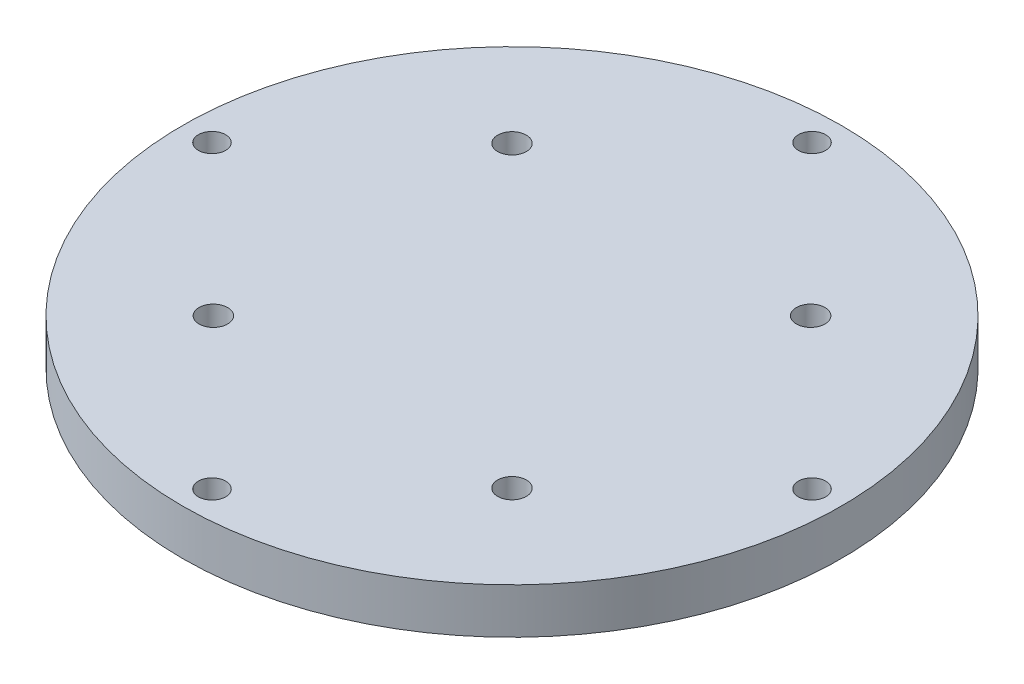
ISO-10303-21;
HEADER;
FILE_DESCRIPTION(('STEP AP214'),'2;1');
FILE_NAME('part.step','',(''),(''),'','','');
FILE_SCHEMA(('AUTOMOTIVE_DESIGN { 1 0 10303 214 1 1 1 1 }'));
ENDSEC;
DATA;
#1=APPLICATION_CONTEXT('core data for automotive mechanical design processes');
#2=APPLICATION_PROTOCOL_DEFINITION('international standard','automotive_design',2000,#1);
#3=PRODUCT_CONTEXT('',#1,'mechanical');
#4=PRODUCT('Part','Part','',(#3));
#5=PRODUCT_RELATED_PRODUCT_CATEGORY('part','',(#4));
#6=PRODUCT_DEFINITION_FORMATION('','',#4);
#7=PRODUCT_DEFINITION_CONTEXT('part definition',#1,'design');
#8=PRODUCT_DEFINITION('design','',#6,#7);
#9=PRODUCT_DEFINITION_SHAPE('','',#8);
#10=(LENGTH_UNIT() NAMED_UNIT(*) SI_UNIT(.MILLI.,.METRE.));
#11=(NAMED_UNIT(*) PLANE_ANGLE_UNIT() SI_UNIT($,.RADIAN.));
#12=(NAMED_UNIT(*) SI_UNIT($,.STERADIAN.) SOLID_ANGLE_UNIT());
#13=UNCERTAINTY_MEASURE_WITH_UNIT(LENGTH_MEASURE(1.E-05),#10,'distance_accuracy_value','');
#14=(GEOMETRIC_REPRESENTATION_CONTEXT(3) GLOBAL_UNCERTAINTY_ASSIGNED_CONTEXT((#13)) GLOBAL_UNIT_ASSIGNED_CONTEXT((#10,
#11,#12)) REPRESENTATION_CONTEXT('',''));
#15=CARTESIAN_POINT('',(0.,0.,0.));
#16=DIRECTION('',(0.,0.,1.));
#17=DIRECTION('',(1.,0.,0.));
#18=AXIS2_PLACEMENT_3D('',#15,#16,#17);
#19=CARTESIAN_POINT('',(0.,6.35,0.));
#20=DIRECTION('',(0.,1.,0.));
#21=DIRECTION('',(0.,0.,1.));
#22=AXIS2_PLACEMENT_3D('',#19,#20,#21);
#23=PLANE('',#22);
#24=CARTESIAN_POINT('',(20.8596500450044,6.35,20.8596500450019));
#25=DIRECTION('',(0.,1.,0.));
#26=DIRECTION('',(0.,0.,1.));
#27=AXIS2_PLACEMENT_3D('',#24,#25,#26);
#28=CIRCLE('',#27,2.00000000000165);
#29=CARTESIAN_POINT('',(20.8596500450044,6.35,22.8596500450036));
#30=VERTEX_POINT('',#29);
#31=EDGE_CURVE('E76',#30,#30,#28,.T.);
#32=ORIENTED_EDGE('',*,*,#31,.F.);
#33=EDGE_LOOP('',(#32));
#34=FACE_BOUND('',#33,.T.);
#35=CARTESIAN_POINT('',(-41.9099999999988,6.35,1.23399553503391E-12));
#36=DIRECTION('',(0.,1.,0.));
#37=DIRECTION('',(0.,0.,1.));
#38=AXIS2_PLACEMENT_3D('',#35,#36,#37);
#39=CIRCLE('',#38,1.905);
#40=CARTESIAN_POINT('',(-41.9099999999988,6.35,1.90500000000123));
#41=VERTEX_POINT('',#40);
#42=EDGE_CURVE('E64',#41,#41,#39,.T.);
#43=ORIENTED_EDGE('',*,*,#42,.F.);
#44=EDGE_LOOP('',(#43));
#45=FACE_BOUND('',#44,.T.);
#46=CARTESIAN_POINT('',(41.9100000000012,6.35,-1.22886304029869E-12));
#47=DIRECTION('',(0.,1.,0.));
#48=DIRECTION('',(0.,0.,1.));
#49=AXIS2_PLACEMENT_3D('',#46,#47,#48);
#50=CIRCLE('',#49,1.905);
#51=CARTESIAN_POINT('',(41.9100000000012,6.35,1.90499999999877));
#52=VERTEX_POINT('',#51);
#53=EDGE_CURVE('E52',#52,#52,#50,.T.);
#54=ORIENTED_EDGE('',*,*,#53,.F.);
#55=EDGE_LOOP('',(#54));
#56=FACE_BOUND('',#55,.T.);
#57=CARTESIAN_POINT('',(0.,6.35,-41.91));
#58=DIRECTION('',(0.,1.,0.));
#59=DIRECTION('',(0.,0.,1.));
#60=AXIS2_PLACEMENT_3D('',#57,#58,#59);
#61=CIRCLE('',#60,1.905);
#62=CARTESIAN_POINT('',(0.,6.35,-40.005));
#63=VERTEX_POINT('',#62);
#64=EDGE_CURVE('E41',#63,#63,#61,.T.);
#65=ORIENTED_EDGE('',*,*,#64,.F.);
#66=EDGE_LOOP('',(#65));
#67=FACE_BOUND('',#66,.T.);
#68=CARTESIAN_POINT('',(0.,6.35,0.));
#69=DIRECTION('',(0.,1.,0.));
#70=DIRECTION('',(0.,0.,1.));
#71=AXIS2_PLACEMENT_3D('',#68,#69,#70);
#72=CIRCLE('',#71,46.0375);
#73=CARTESIAN_POINT('',(0.,6.35,46.0375));
#74=VERTEX_POINT('',#73);
#75=EDGE_CURVE('E10',#74,#74,#72,.T.);
#76=ORIENTED_EDGE('',*,*,#75,.T.);
#77=EDGE_LOOP('',(#76));
#78=FACE_BOUND('',#77,.T.);
#79=CARTESIAN_POINT('',(-20.8596500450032,6.35,-20.8596500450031));
#80=DIRECTION('',(0.,1.,0.));
#81=DIRECTION('',(0.,0.,1.));
#82=AXIS2_PLACEMENT_3D('',#79,#80,#81);
#83=CIRCLE('',#82,2.00000000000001);
#84=CARTESIAN_POINT('',(-20.8596500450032,6.35,-18.8596500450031));
#85=VERTEX_POINT('',#84);
#86=EDGE_CURVE('E46',#85,#85,#83,.T.);
#87=ORIENTED_EDGE('',*,*,#86,.F.);
#88=EDGE_LOOP('',(#87));
#89=FACE_BOUND('',#88,.T.);
#90=CARTESIAN_POINT('',(2.45074666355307E-12,6.35,41.91));
#91=DIRECTION('',(0.,1.,0.));
#92=DIRECTION('',(0.,0.,1.));
#93=AXIS2_PLACEMENT_3D('',#90,#91,#92);
#94=CIRCLE('',#93,1.905);
#95=CARTESIAN_POINT('',(2.45074666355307E-12,6.35,43.815));
#96=VERTEX_POINT('',#95);
#97=EDGE_CURVE('E58',#96,#96,#94,.T.);
#98=ORIENTED_EDGE('',*,*,#97,.F.);
#99=EDGE_LOOP('',(#98));
#100=FACE_BOUND('',#99,.T.);
#101=CARTESIAN_POINT('',(20.8596500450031,6.35,-20.8596500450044));
#102=DIRECTION('',(0.,1.,0.));
#103=DIRECTION('',(0.,0.,1.));
#104=AXIS2_PLACEMENT_3D('',#101,#102,#103);
#105=CIRCLE('',#104,2.00000000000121);
#106=CARTESIAN_POINT('',(20.8596500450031,6.35,-18.8596500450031));
#107=VERTEX_POINT('',#106);
#108=EDGE_CURVE('E70',#107,#107,#105,.T.);
#109=ORIENTED_EDGE('',*,*,#108,.F.);
#110=EDGE_LOOP('',(#109));
#111=FACE_BOUND('',#110,.T.);
#112=CARTESIAN_POINT('',(-20.8596500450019,6.35,20.8596500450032));
#113=DIRECTION('',(0.,1.,0.));
#114=DIRECTION('',(0.,0.,1.));
#115=AXIS2_PLACEMENT_3D('',#112,#113,#114);
#116=CIRCLE('',#115,2.00000000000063);
#117=CARTESIAN_POINT('',(-20.8596500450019,6.35,22.8596500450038));
#118=VERTEX_POINT('',#117);
#119=EDGE_CURVE('E82',#118,#118,#116,.T.);
#120=ORIENTED_EDGE('',*,*,#119,.F.);
#121=EDGE_LOOP('',(#120));
#122=FACE_BOUND('',#121,.T.);
#123=ADVANCED_FACE('F30',(#34,#45,#56,#67,#78,#89,#100,#111,#122),#23,.T.);
#124=CARTESIAN_POINT('',(0.,0.,0.));
#125=DIRECTION('',(0.,1.,0.));
#126=DIRECTION('',(0.,0.,1.));
#127=AXIS2_PLACEMENT_3D('',#124,#125,#126);
#128=PLANE('',#127);
#129=CARTESIAN_POINT('',(0.,0.,0.));
#130=DIRECTION('',(0.,1.,0.));
#131=DIRECTION('',(0.,0.,1.));
#132=AXIS2_PLACEMENT_3D('',#129,#130,#131);
#133=CIRCLE('',#132,46.0375);
#134=CARTESIAN_POINT('',(0.,0.,46.0375));
#135=VERTEX_POINT('',#134);
#136=EDGE_CURVE('E34',#135,#135,#133,.T.);
#137=ORIENTED_EDGE('',*,*,#136,.F.);
#138=EDGE_LOOP('',(#137));
#139=FACE_BOUND('',#138,.T.);
#140=CARTESIAN_POINT('',(0.,0.,-41.91));
#141=DIRECTION('',(0.,1.,0.));
#142=DIRECTION('',(0.,0.,1.));
#143=AXIS2_PLACEMENT_3D('',#140,#141,#142);
#144=CIRCLE('',#143,1.905);
#145=CARTESIAN_POINT('',(0.,0.,-40.005));
#146=VERTEX_POINT('',#145);
#147=EDGE_CURVE('E43',#146,#146,#144,.T.);
#148=ORIENTED_EDGE('',*,*,#147,.T.);
#149=EDGE_LOOP('',(#148));
#150=FACE_BOUND('',#149,.T.);
#151=CARTESIAN_POINT('',(-20.8596500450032,0.,-20.8596500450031));
#152=DIRECTION('',(0.,1.,0.));
#153=DIRECTION('',(0.,0.,1.));
#154=AXIS2_PLACEMENT_3D('',#151,#152,#153);
#155=CIRCLE('',#154,2.00000000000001);
#156=CARTESIAN_POINT('',(-20.8596500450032,0.,-18.8596500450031));
#157=VERTEX_POINT('',#156);
#158=EDGE_CURVE('E49',#157,#157,#155,.T.);
#159=ORIENTED_EDGE('',*,*,#158,.T.);
#160=EDGE_LOOP('',(#159));
#161=FACE_BOUND('',#160,.T.);
#162=CARTESIAN_POINT('',(41.9100000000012,0.,-1.22886304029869E-12));
#163=DIRECTION('',(0.,1.,0.));
#164=DIRECTION('',(0.,0.,1.));
#165=AXIS2_PLACEMENT_3D('',#162,#163,#164);
#166=CIRCLE('',#165,1.905);
#167=CARTESIAN_POINT('',(41.9100000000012,0.,1.90499999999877));
#168=VERTEX_POINT('',#167);
#169=EDGE_CURVE('E55',#168,#168,#166,.T.);
#170=ORIENTED_EDGE('',*,*,#169,.T.);
#171=EDGE_LOOP('',(#170));
#172=FACE_BOUND('',#171,.T.);
#173=CARTESIAN_POINT('',(2.45074666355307E-12,0.,41.91));
#174=DIRECTION('',(0.,1.,0.));
#175=DIRECTION('',(0.,0.,1.));
#176=AXIS2_PLACEMENT_3D('',#173,#174,#175);
#177=CIRCLE('',#176,1.905);
#178=CARTESIAN_POINT('',(2.45074666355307E-12,0.,43.815));
#179=VERTEX_POINT('',#178);
#180=EDGE_CURVE('E61',#179,#179,#177,.T.);
#181=ORIENTED_EDGE('',*,*,#180,.T.);
#182=EDGE_LOOP('',(#181));
#183=FACE_BOUND('',#182,.T.);
#184=CARTESIAN_POINT('',(-41.9099999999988,0.,1.23399553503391E-12));
#185=DIRECTION('',(0.,1.,0.));
#186=DIRECTION('',(0.,0.,1.));
#187=AXIS2_PLACEMENT_3D('',#184,#185,#186);
#188=CIRCLE('',#187,1.905);
#189=CARTESIAN_POINT('',(-41.9099999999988,0.,1.90500000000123));
#190=VERTEX_POINT('',#189);
#191=EDGE_CURVE('E67',#190,#190,#188,.T.);
#192=ORIENTED_EDGE('',*,*,#191,.T.);
#193=EDGE_LOOP('',(#192));
#194=FACE_BOUND('',#193,.T.);
#195=CARTESIAN_POINT('',(20.8596500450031,0.,-20.8596500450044));
#196=DIRECTION('',(0.,1.,0.));
#197=DIRECTION('',(0.,0.,1.));
#198=AXIS2_PLACEMENT_3D('',#195,#196,#197);
#199=CIRCLE('',#198,2.00000000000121);
#200=CARTESIAN_POINT('',(20.8596500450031,0.,-18.8596500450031));
#201=VERTEX_POINT('',#200);
#202=EDGE_CURVE('E73',#201,#201,#199,.T.);
#203=ORIENTED_EDGE('',*,*,#202,.T.);
#204=EDGE_LOOP('',(#203));
#205=FACE_BOUND('',#204,.T.);
#206=CARTESIAN_POINT('',(20.8596500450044,0.,20.8596500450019));
#207=DIRECTION('',(0.,1.,0.));
#208=DIRECTION('',(0.,0.,1.));
#209=AXIS2_PLACEMENT_3D('',#206,#207,#208);
#210=CIRCLE('',#209,2.00000000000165);
#211=CARTESIAN_POINT('',(20.8596500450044,0.,22.8596500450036));
#212=VERTEX_POINT('',#211);
#213=EDGE_CURVE('E79',#212,#212,#210,.T.);
#214=ORIENTED_EDGE('',*,*,#213,.T.);
#215=EDGE_LOOP('',(#214));
#216=FACE_BOUND('',#215,.T.);
#217=CARTESIAN_POINT('',(-20.8596500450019,0.,20.8596500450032));
#218=DIRECTION('',(0.,1.,0.));
#219=DIRECTION('',(0.,0.,1.));
#220=AXIS2_PLACEMENT_3D('',#217,#218,#219);
#221=CIRCLE('',#220,2.00000000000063);
#222=CARTESIAN_POINT('',(-20.8596500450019,0.,22.8596500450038));
#223=VERTEX_POINT('',#222);
#224=EDGE_CURVE('E85',#223,#223,#221,.T.);
#225=ORIENTED_EDGE('',*,*,#224,.T.);
#226=EDGE_LOOP('',(#225));
#227=FACE_BOUND('',#226,.T.);
#228=ADVANCED_FACE('F95',(#139,#150,#161,#172,#183,#194,#205,#216,#227),#128,.F.);
#229=CARTESIAN_POINT('',(0.,6.35,0.));
#230=DIRECTION('',(0.,-1.,0.));
#231=DIRECTION('',(0.,0.,-1.));
#232=AXIS2_PLACEMENT_3D('',#229,#230,#231);
#233=CYLINDRICAL_SURFACE('',#232,46.0375);
#234=ORIENTED_EDGE('',*,*,#75,.F.);
#235=EDGE_LOOP('',(#234));
#236=FACE_BOUND('',#235,.T.);
#237=ORIENTED_EDGE('',*,*,#136,.T.);
#238=EDGE_LOOP('',(#237));
#239=FACE_BOUND('',#238,.T.);
#240=ADVANCED_FACE('F32',(#236,#239),#233,.T.);
#241=CARTESIAN_POINT('',(0.,6.35,-41.91));
#242=DIRECTION('',(0.,-1.,0.));
#243=DIRECTION('',(0.,0.,-1.));
#244=AXIS2_PLACEMENT_3D('',#241,#242,#243);
#245=CYLINDRICAL_SURFACE('',#244,1.905);
#246=ORIENTED_EDGE('',*,*,#64,.T.);
#247=EDGE_LOOP('',(#246));
#248=FACE_BOUND('',#247,.T.);
#249=ORIENTED_EDGE('',*,*,#147,.F.);
#250=EDGE_LOOP('',(#249));
#251=FACE_BOUND('',#250,.T.);
#252=ADVANCED_FACE('F105',(#248,#251),#245,.F.);
#253=CARTESIAN_POINT('',(-20.8596500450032,6.35,-20.8596500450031));
#254=DIRECTION('',(0.,-1.,0.));
#255=DIRECTION('',(0.,0.,-1.));
#256=AXIS2_PLACEMENT_3D('',#253,#254,#255);
#257=CYLINDRICAL_SURFACE('',#256,2.00000000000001);
#258=ORIENTED_EDGE('',*,*,#86,.T.);
#259=EDGE_LOOP('',(#258));
#260=FACE_BOUND('',#259,.T.);
#261=ORIENTED_EDGE('',*,*,#158,.F.);
#262=EDGE_LOOP('',(#261));
#263=FACE_BOUND('',#262,.T.);
#264=ADVANCED_FACE('F108',(#260,#263),#257,.F.);
#265=CARTESIAN_POINT('',(41.9100000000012,6.35,-1.22886304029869E-12));
#266=DIRECTION('',(0.,-1.,0.));
#267=DIRECTION('',(0.,0.,-1.));
#268=AXIS2_PLACEMENT_3D('',#265,#266,#267);
#269=CYLINDRICAL_SURFACE('',#268,1.905);
#270=ORIENTED_EDGE('',*,*,#53,.T.);
#271=EDGE_LOOP('',(#270));
#272=FACE_BOUND('',#271,.T.);
#273=ORIENTED_EDGE('',*,*,#169,.F.);
#274=EDGE_LOOP('',(#273));
#275=FACE_BOUND('',#274,.T.);
#276=ADVANCED_FACE('F112',(#272,#275),#269,.F.);
#277=CARTESIAN_POINT('',(2.45074666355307E-12,6.35,41.91));
#278=DIRECTION('',(0.,-1.,0.));
#279=DIRECTION('',(0.,0.,-1.));
#280=AXIS2_PLACEMENT_3D('',#277,#278,#279);
#281=CYLINDRICAL_SURFACE('',#280,1.905);
#282=ORIENTED_EDGE('',*,*,#97,.T.);
#283=EDGE_LOOP('',(#282));
#284=FACE_BOUND('',#283,.T.);
#285=ORIENTED_EDGE('',*,*,#180,.F.);
#286=EDGE_LOOP('',(#285));
#287=FACE_BOUND('',#286,.T.);
#288=ADVANCED_FACE('F116',(#284,#287),#281,.F.);
#289=CARTESIAN_POINT('',(-41.9099999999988,6.35,1.23399553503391E-12));
#290=DIRECTION('',(0.,-1.,0.));
#291=DIRECTION('',(0.,0.,-1.));
#292=AXIS2_PLACEMENT_3D('',#289,#290,#291);
#293=CYLINDRICAL_SURFACE('',#292,1.905);
#294=ORIENTED_EDGE('',*,*,#42,.T.);
#295=EDGE_LOOP('',(#294));
#296=FACE_BOUND('',#295,.T.);
#297=ORIENTED_EDGE('',*,*,#191,.F.);
#298=EDGE_LOOP('',(#297));
#299=FACE_BOUND('',#298,.T.);
#300=ADVANCED_FACE('F120',(#296,#299),#293,.F.);
#301=CARTESIAN_POINT('',(20.8596500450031,6.35,-20.8596500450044));
#302=DIRECTION('',(0.,-1.,0.));
#303=DIRECTION('',(0.,0.,-1.));
#304=AXIS2_PLACEMENT_3D('',#301,#302,#303);
#305=CYLINDRICAL_SURFACE('',#304,2.00000000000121);
#306=ORIENTED_EDGE('',*,*,#108,.T.);
#307=EDGE_LOOP('',(#306));
#308=FACE_BOUND('',#307,.T.);
#309=ORIENTED_EDGE('',*,*,#202,.F.);
#310=EDGE_LOOP('',(#309));
#311=FACE_BOUND('',#310,.T.);
#312=ADVANCED_FACE('F124',(#308,#311),#305,.F.);
#313=CARTESIAN_POINT('',(20.8596500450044,6.35,20.8596500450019));
#314=DIRECTION('',(0.,-1.,0.));
#315=DIRECTION('',(0.,0.,-1.));
#316=AXIS2_PLACEMENT_3D('',#313,#314,#315);
#317=CYLINDRICAL_SURFACE('',#316,2.00000000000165);
#318=ORIENTED_EDGE('',*,*,#31,.T.);
#319=EDGE_LOOP('',(#318));
#320=FACE_BOUND('',#319,.T.);
#321=ORIENTED_EDGE('',*,*,#213,.F.);
#322=EDGE_LOOP('',(#321));
#323=FACE_BOUND('',#322,.T.);
#324=ADVANCED_FACE('F128',(#320,#323),#317,.F.);
#325=CARTESIAN_POINT('',(-20.8596500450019,6.35,20.8596500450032));
#326=DIRECTION('',(0.,-1.,0.));
#327=DIRECTION('',(0.,0.,-1.));
#328=AXIS2_PLACEMENT_3D('',#325,#326,#327);
#329=CYLINDRICAL_SURFACE('',#328,2.00000000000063);
#330=ORIENTED_EDGE('',*,*,#119,.T.);
#331=EDGE_LOOP('',(#330));
#332=FACE_BOUND('',#331,.T.);
#333=ORIENTED_EDGE('',*,*,#224,.F.);
#334=EDGE_LOOP('',(#333));
#335=FACE_BOUND('',#334,.T.);
#336=ADVANCED_FACE('F91',(#332,#335),#329,.F.);
#337=CLOSED_SHELL('',(#123,#228,#240,#252,#264,#276,#288,#300,#312,#324,#336));
#338=MANIFOLD_SOLID_BREP('B2',#337);
#339=ADVANCED_BREP_SHAPE_REPRESENTATION('',(#18,#338),#14);
#340=SHAPE_DEFINITION_REPRESENTATION(#9,#339);
ENDSEC;
END-ISO-10303-21;
